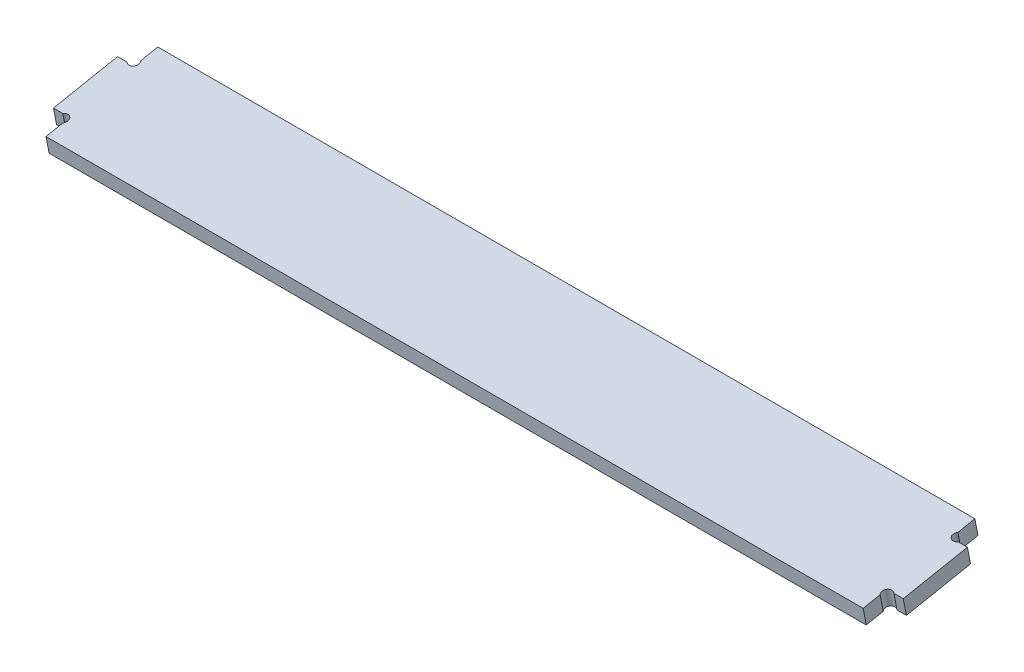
ISO-10303-21;
HEADER;
FILE_DESCRIPTION(('STEP AP214'),'2;1');
FILE_NAME('part.step','',(''),(''),'','','');
FILE_SCHEMA(('AUTOMOTIVE_DESIGN { 1 0 10303 214 1 1 1 1 }'));
ENDSEC;
DATA;
#1=APPLICATION_CONTEXT('core data for automotive mechanical design processes');
#2=APPLICATION_PROTOCOL_DEFINITION('international standard','automotive_design',2000,#1);
#3=PRODUCT_CONTEXT('',#1,'mechanical');
#4=PRODUCT('Part','Part','',(#3));
#5=PRODUCT_RELATED_PRODUCT_CATEGORY('part','',(#4));
#6=PRODUCT_DEFINITION_FORMATION('','',#4);
#7=PRODUCT_DEFINITION_CONTEXT('part definition',#1,'design');
#8=PRODUCT_DEFINITION('design','',#6,#7);
#9=PRODUCT_DEFINITION_SHAPE('','',#8);
#10=(LENGTH_UNIT() NAMED_UNIT(*) SI_UNIT(.MILLI.,.METRE.));
#11=(NAMED_UNIT(*) PLANE_ANGLE_UNIT() SI_UNIT($,.RADIAN.));
#12=(NAMED_UNIT(*) SI_UNIT($,.STERADIAN.) SOLID_ANGLE_UNIT());
#13=UNCERTAINTY_MEASURE_WITH_UNIT(LENGTH_MEASURE(1.E-05),#10,'distance_accuracy_value','');
#14=(GEOMETRIC_REPRESENTATION_CONTEXT(3) GLOBAL_UNCERTAINTY_ASSIGNED_CONTEXT((#13)) GLOBAL_UNIT_ASSIGNED_CONTEXT((#10,
#11,#12)) REPRESENTATION_CONTEXT('',''));
#15=CARTESIAN_POINT('',(0.,0.,0.));
#16=DIRECTION('',(0.,0.,1.));
#17=DIRECTION('',(1.,0.,0.));
#18=AXIS2_PLACEMENT_3D('',#15,#16,#17);
#19=CARTESIAN_POINT('',(0.,593.86769603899,-52.1972085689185));
#20=DIRECTION('',(-1.,0.,0.));
#21=DIRECTION('',(0.,0.229075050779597,0.973408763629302));
#22=AXIS2_PLACEMENT_3D('',#19,#20,#21);
#23=PLANE('',#22);
#24=DIRECTION('',(0.,0.981676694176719,0.19055410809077));
#25=VECTOR('',#24,1.);
#26=CARTESIAN_POINT('',(0.,492.61730867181,-70.4734239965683));
#27=LINE('',#26,#25);
#28=CARTESIAN_POINT('',(0.,505.409359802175,-67.9903479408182));
#29=VERTEX_POINT('',#28);
#30=CARTESIAN_POINT('',(0.,515.226126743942,-66.0848068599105));
#31=VERTEX_POINT('',#30);
#32=EDGE_CURVE('E295',#29,#31,#27,.T.);
#33=ORIENTED_EDGE('',*,*,#32,.F.);
#34=DIRECTION('',(0.,-0.190554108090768,0.981676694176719));
#35=VECTOR('',#34,1.);
#36=CARTESIAN_POINT('',(0.,494.152803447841,-10.));
#37=LINE('',#36,#35);
#38=CARTESIAN_POINT('',(0.,507.42684660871,-78.3838251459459));
#39=VERTEX_POINT('',#38);
#40=EDGE_CURVE('E218',#39,#29,#37,.T.);
#41=ORIENTED_EDGE('',*,*,#40,.F.);
#42=DIRECTION('',(0.,-0.981676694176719,-0.190554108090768));
#43=VECTOR('',#42,1.);
#44=CARTESIAN_POINT('',(0.,507.42684660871,-78.3838251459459));
#45=LINE('',#44,#43);
#46=CARTESIAN_POINT('',(0.,517.243613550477,-76.4782840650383));
#47=VERTEX_POINT('',#46);
#48=EDGE_CURVE('E214',#47,#39,#45,.T.);
#49=ORIENTED_EDGE('',*,*,#48,.F.);
#50=DIRECTION('',(0.,0.19055410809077,-0.981676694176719));
#51=VECTOR('',#50,1.);
#52=CARTESIAN_POINT('',(0.,503.969570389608,-8.09445891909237));
#53=LINE('',#52,#51);
#54=EDGE_CURVE('E248',#31,#47,#53,.T.);
#55=ORIENTED_EDGE('',*,*,#54,.F.);
#56=EDGE_LOOP('',(#33,#41,#49,#55));
#57=FACE_BOUND('',#56,.T.);
#58=ADVANCED_FACE('F33',(#57),#23,.F.);
#59=DIRECTION('',(0.,0.981676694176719,0.19055410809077));
#60=VECTOR('',#59,1.);
#61=CARTESIAN_POINT('',(0.,483.378239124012,-22.8765532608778));
#62=LINE('',#61,#60);
#63=CARTESIAN_POINT('',(0.,505.987057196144,-18.4879361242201));
#64=VERTEX_POINT('',#63);
#65=CARTESIAN_POINT('',(0.,496.170290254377,-20.3934772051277));
#66=VERTEX_POINT('',#65);
#67=EDGE_CURVE('E154',#64,#66,#62,.F.);
#68=ORIENTED_EDGE('',*,*,#67,.F.);
#69=CARTESIAN_POINT('',(0.,503.969570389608,-8.09445891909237));
#70=VERTEX_POINT('',#69);
#71=EDGE_CURVE('E152',#70,#64,#53,.T.);
#72=ORIENTED_EDGE('',*,*,#71,.F.);
#73=DIRECTION('',(0.,0.981676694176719,0.190554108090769));
#74=VECTOR('',#73,1.);
#75=CARTESIAN_POINT('',(0.,494.152803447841,-10.));
#76=LINE('',#75,#74);
#77=CARTESIAN_POINT('',(0.,494.152803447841,-10.));
#78=VERTEX_POINT('',#77);
#79=EDGE_CURVE('E221',#78,#70,#76,.T.);
#80=ORIENTED_EDGE('',*,*,#79,.F.);
#81=EDGE_CURVE('E217',#66,#78,#37,.T.);
#82=ORIENTED_EDGE('',*,*,#81,.F.);
#83=EDGE_LOOP('',(#68,#72,#80,#82));
#84=FACE_BOUND('',#83,.T.);
#85=ADVANCED_FACE('F292',(#84),#23,.F.);
#86=CARTESIAN_POINT('',(0.,504.600907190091,-63.8254464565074));
#87=DIRECTION('',(0.,-0.19055410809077,0.981676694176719));
#88=DIRECTION('',(0.,-0.981676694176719,-0.19055410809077));
#89=AXIS2_PLACEMENT_3D('',#86,#87,#88);
#90=PLANE('',#89);
#91=DIRECTION('',(0.,0.981676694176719,0.19055410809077));
#92=VECTOR('',#91,1.);
#93=CARTESIAN_POINT('',(4.24264068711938,491.808856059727,-66.3085225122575));
#94=LINE('',#93,#92);
#95=CARTESIAN_POINT('',(4.24264068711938,514.417674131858,-61.9199053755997));
#96=VERTEX_POINT('',#95);
#97=CARTESIAN_POINT('',(4.24264068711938,504.600907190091,-63.8254464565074));
#98=VERTEX_POINT('',#97);
#99=EDGE_CURVE('E11',#96,#98,#94,.F.);
#100=ORIENTED_EDGE('',*,*,#99,.F.);
#101=DIRECTION('',(1.,0.,0.));
#102=VECTOR('',#101,1.);
#103=CARTESIAN_POINT('',(0.,514.417674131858,-61.9199053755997));
#104=LINE('',#103,#102);
#105=CARTESIAN_POINT('',(10.,514.417674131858,-61.9199053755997));
#106=VERTEX_POINT('',#105);
#107=EDGE_CURVE('E166',#96,#106,#104,.T.);
#108=ORIENTED_EDGE('',*,*,#107,.T.);
#109=DIRECTION('',(0.,0.981676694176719,0.19055410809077));
#110=VECTOR('',#109,1.);
#111=CARTESIAN_POINT('',(10.,504.600907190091,-63.8254464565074));
#112=LINE('',#111,#110);
#113=CARTESIAN_POINT('',(10.,504.600907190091,-63.8254464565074));
#114=VERTEX_POINT('',#113);
#115=EDGE_CURVE('E173',#114,#106,#112,.T.);
#116=ORIENTED_EDGE('',*,*,#115,.F.);
#117=DIRECTION('',(1.,0.,0.));
#118=VECTOR('',#117,1.);
#119=CARTESIAN_POINT('',(0.,504.600907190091,-63.8254464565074));
#120=LINE('',#119,#118);
#121=EDGE_CURVE('E168',#98,#114,#120,.T.);
#122=ORIENTED_EDGE('',*,*,#121,.F.);
#123=EDGE_LOOP('',(#100,#108,#116,#122));
#124=FACE_BOUND('',#123,.T.);
#125=ADVANCED_FACE('F312',(#124),#90,.F.);
#126=CARTESIAN_POINT('',(0.,496.97874286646,-24.5583786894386));
#127=DIRECTION('',(0.,0.19055410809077,-0.981676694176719));
#128=DIRECTION('',(0.,0.981676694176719,0.19055410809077));
#129=AXIS2_PLACEMENT_3D('',#126,#127,#128);
#130=PLANE('',#129);
#131=DIRECTION('',(0.,0.981676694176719,0.19055410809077));
#132=VECTOR('',#131,1.);
#133=CARTESIAN_POINT('',(4.24264068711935,484.186691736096,-27.0414547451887));
#134=LINE('',#133,#132);
#135=CARTESIAN_POINT('',(4.24264068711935,496.97874286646,-24.5583786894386));
#136=VERTEX_POINT('',#135);
#137=CARTESIAN_POINT('',(4.24264068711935,506.795509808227,-22.6528376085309));
#138=VERTEX_POINT('',#137);
#139=EDGE_CURVE('E41',#136,#138,#134,.T.);
#140=ORIENTED_EDGE('',*,*,#139,.F.);
#141=DIRECTION('',(-1.,0.,0.));
#142=VECTOR('',#141,1.);
#143=CARTESIAN_POINT('',(0.,496.97874286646,-24.5583786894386));
#144=LINE('',#143,#142);
#145=CARTESIAN_POINT('',(10.,496.97874286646,-24.5583786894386));
#146=VERTEX_POINT('',#145);
#147=EDGE_CURVE('E302',#146,#136,#144,.T.);
#148=ORIENTED_EDGE('',*,*,#147,.F.);
#149=DIRECTION('',(0.,0.981676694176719,0.19055410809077));
#150=VECTOR('',#149,1.);
#151=CARTESIAN_POINT('',(10.,496.97874286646,-24.5583786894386));
#152=LINE('',#151,#150);
#153=CARTESIAN_POINT('',(10.,506.795509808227,-22.6528376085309));
#154=VERTEX_POINT('',#153);
#155=EDGE_CURVE('E164',#146,#154,#152,.T.);
#156=ORIENTED_EDGE('',*,*,#155,.T.);
#157=DIRECTION('',(-1.,0.,0.));
#158=VECTOR('',#157,1.);
#159=CARTESIAN_POINT('',(0.,506.795509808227,-22.6528376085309));
#160=LINE('',#159,#158);
#161=EDGE_CURVE('E150',#154,#138,#160,.T.);
#162=ORIENTED_EDGE('',*,*,#161,.T.);
#163=EDGE_LOOP('',(#140,#148,#156,#162));
#164=FACE_BOUND('',#163,.T.);
#165=ADVANCED_FACE('F162',(#164),#130,.F.);
#166=CARTESIAN_POINT('',(-500.,0.,0.));
#167=DIRECTION('',(-1.,0.,0.));
#168=DIRECTION('',(0.,0.,1.));
#169=AXIS2_PLACEMENT_3D('',#166,#167,#168);
#170=PLANE('',#169);
#171=DIRECTION('',(0.,0.981676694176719,0.19055410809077));
#172=VECTOR('',#171,1.);
#173=CARTESIAN_POINT('',(-500.,492.61730867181,-70.4734239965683));
#174=LINE('',#173,#172);
#175=CARTESIAN_POINT('',(-500.,515.226126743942,-66.0848068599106));
#176=VERTEX_POINT('',#175);
#177=CARTESIAN_POINT('',(-500.,505.409359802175,-67.9903479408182));
#178=VERTEX_POINT('',#177);
#179=EDGE_CURVE('E188',#176,#178,#174,.F.);
#180=ORIENTED_EDGE('',*,*,#179,.F.);
#181=DIRECTION('',(0.,-0.19055410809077,0.981676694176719));
#182=VECTOR('',#181,1.);
#183=CARTESIAN_POINT('',(-500.,503.969570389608,-8.09445891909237));
#184=LINE('',#183,#182);
#185=CARTESIAN_POINT('',(-500.,517.243613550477,-76.4782840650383));
#186=VERTEX_POINT('',#185);
#187=EDGE_CURVE('E235',#186,#176,#184,.T.);
#188=ORIENTED_EDGE('',*,*,#187,.F.);
#189=DIRECTION('',(0.,0.981676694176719,0.190554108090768));
#190=VECTOR('',#189,1.);
#191=CARTESIAN_POINT('',(-500.,507.42684660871,-78.3838251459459));
#192=LINE('',#191,#190);
#193=CARTESIAN_POINT('',(-500.,507.42684660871,-78.3838251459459));
#194=VERTEX_POINT('',#193);
#195=EDGE_CURVE('E231',#194,#186,#192,.T.);
#196=ORIENTED_EDGE('',*,*,#195,.F.);
#197=DIRECTION('',(0.,0.190554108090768,-0.981676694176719));
#198=VECTOR('',#197,1.);
#199=CARTESIAN_POINT('',(-500.,494.152803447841,-10.));
#200=LINE('',#199,#198);
#201=EDGE_CURVE('E227',#178,#194,#200,.T.);
#202=ORIENTED_EDGE('',*,*,#201,.F.);
#203=EDGE_LOOP('',(#180,#188,#196,#202));
#204=FACE_BOUND('',#203,.T.);
#205=ADVANCED_FACE('F267',(#204),#170,.T.);
#206=DIRECTION('',(0.,0.981676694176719,0.19055410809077));
#207=VECTOR('',#206,1.);
#208=CARTESIAN_POINT('',(-500.,483.378239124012,-22.8765532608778));
#209=LINE('',#208,#207);
#210=CARTESIAN_POINT('',(-500.,496.170290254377,-20.3934772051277));
#211=VERTEX_POINT('',#210);
#212=CARTESIAN_POINT('',(-500.,505.987057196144,-18.4879361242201));
#213=VERTEX_POINT('',#212);
#214=EDGE_CURVE('E183',#211,#213,#209,.T.);
#215=ORIENTED_EDGE('',*,*,#214,.F.);
#216=CARTESIAN_POINT('',(-500.,494.152803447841,-10.));
#217=VERTEX_POINT('',#216);
#218=EDGE_CURVE('E228',#217,#211,#200,.T.);
#219=ORIENTED_EDGE('',*,*,#218,.F.);
#220=DIRECTION('',(0.,-0.981676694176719,-0.190554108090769));
#221=VECTOR('',#220,1.);
#222=CARTESIAN_POINT('',(-500.,494.152803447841,-10.));
#223=LINE('',#222,#221);
#224=CARTESIAN_POINT('',(-500.,503.969570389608,-8.09445891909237));
#225=VERTEX_POINT('',#224);
#226=EDGE_CURVE('E211',#225,#217,#223,.T.);
#227=ORIENTED_EDGE('',*,*,#226,.F.);
#228=EDGE_CURVE('E234',#213,#225,#184,.T.);
#229=ORIENTED_EDGE('',*,*,#228,.F.);
#230=EDGE_LOOP('',(#215,#219,#227,#229));
#231=FACE_BOUND('',#230,.T.);
#232=ADVANCED_FACE('F285',(#231),#170,.T.);
#233=CARTESIAN_POINT('',(73.9850019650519,503.969570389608,-8.09445891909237));
#234=DIRECTION('',(0.,-0.981676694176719,-0.19055410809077));
#235=DIRECTION('',(0.,0.19055410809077,-0.981676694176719));
#236=AXIS2_PLACEMENT_3D('',#233,#234,#235);
#237=PLANE('',#236);
#238=CARTESIAN_POINT('',(2.12132034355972,514.8219004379,-64.0023561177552));
#239=DIRECTION('',(0.,-0.981676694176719,-0.19055410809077));
#240=DIRECTION('',(0.,0.19055410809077,-0.981676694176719));
#241=AXIS2_PLACEMENT_3D('',#238,#239,#240);
#242=CIRCLE('',#241,3.);
#243=EDGE_CURVE('E47',#31,#96,#242,.F.);
#244=ORIENTED_EDGE('',*,*,#243,.F.);
#245=ORIENTED_EDGE('',*,*,#54,.T.);
#246=DIRECTION('',(-1.,0.,0.));
#247=VECTOR('',#246,1.);
#248=CARTESIAN_POINT('',(73.9850019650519,517.243613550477,-76.4782840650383));
#249=LINE('',#248,#247);
#250=EDGE_CURVE('E241',#47,#186,#249,.T.);
#251=ORIENTED_EDGE('',*,*,#250,.T.);
#252=ORIENTED_EDGE('',*,*,#187,.T.);
#253=CARTESIAN_POINT('',(-502.12132034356,514.8219004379,-64.0023561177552));
#254=DIRECTION('',(0.,-0.981676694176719,-0.19055410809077));
#255=DIRECTION('',(0.,0.19055410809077,-0.981676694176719));
#256=AXIS2_PLACEMENT_3D('',#253,#254,#255);
#257=CIRCLE('',#256,3.);
#258=CARTESIAN_POINT('',(-504.242640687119,514.417674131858,-61.9199053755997));
#259=VERTEX_POINT('',#258);
#260=EDGE_CURVE('E189',#176,#259,#257,.T.);
#261=ORIENTED_EDGE('',*,*,#260,.T.);
#262=DIRECTION('',(-1.,0.,0.));
#263=VECTOR('',#262,1.);
#264=CARTESIAN_POINT('',(-500.,514.417674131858,-61.9199053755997));
#265=LINE('',#264,#263);
#266=CARTESIAN_POINT('',(-510.,514.417674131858,-61.9199053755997));
#267=VERTEX_POINT('',#266);
#268=EDGE_CURVE('E191',#259,#267,#265,.T.);
#269=ORIENTED_EDGE('',*,*,#268,.T.);
#270=DIRECTION('',(0.,-0.190554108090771,0.981676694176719));
#271=VECTOR('',#270,1.);
#272=CARTESIAN_POINT('',(-510.,514.417674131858,-61.9199053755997));
#273=LINE('',#272,#271);
#274=CARTESIAN_POINT('',(-510.,506.795509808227,-22.6528376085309));
#275=VERTEX_POINT('',#274);
#276=EDGE_CURVE('E204',#267,#275,#273,.T.);
#277=ORIENTED_EDGE('',*,*,#276,.T.);
#278=DIRECTION('',(1.,0.,0.));
#279=VECTOR('',#278,1.);
#280=CARTESIAN_POINT('',(-500.,506.795509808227,-22.6528376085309));
#281=LINE('',#280,#279);
#282=CARTESIAN_POINT('',(-504.242640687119,506.795509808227,-22.6528376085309));
#283=VERTEX_POINT('',#282);
#284=EDGE_CURVE('E196',#275,#283,#281,.T.);
#285=ORIENTED_EDGE('',*,*,#284,.T.);
#286=CARTESIAN_POINT('',(-502.12132034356,506.391283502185,-20.5703868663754));
#287=DIRECTION('',(0.,-0.981676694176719,-0.19055410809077));
#288=DIRECTION('',(0.,0.19055410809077,-0.981676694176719));
#289=AXIS2_PLACEMENT_3D('',#286,#287,#288);
#290=CIRCLE('',#289,2.99999999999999);
#291=EDGE_CURVE('E180',#283,#213,#290,.T.);
#292=ORIENTED_EDGE('',*,*,#291,.T.);
#293=ORIENTED_EDGE('',*,*,#228,.T.);
#294=DIRECTION('',(-1.,0.,0.));
#295=VECTOR('',#294,1.);
#296=CARTESIAN_POINT('',(73.9850019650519,503.969570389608,-8.09445891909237));
#297=LINE('',#296,#295);
#298=EDGE_CURVE('E238',#70,#225,#297,.T.);
#299=ORIENTED_EDGE('',*,*,#298,.F.);
#300=ORIENTED_EDGE('',*,*,#71,.T.);
#301=CARTESIAN_POINT('',(2.12132034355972,506.391283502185,-20.5703868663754));
#302=DIRECTION('',(0.,-0.981676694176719,-0.19055410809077));
#303=DIRECTION('',(0.,0.19055410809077,-0.981676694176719));
#304=AXIS2_PLACEMENT_3D('',#301,#302,#303);
#305=CIRCLE('',#304,2.99999999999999);
#306=EDGE_CURVE('E146',#138,#64,#305,.F.);
#307=ORIENTED_EDGE('',*,*,#306,.F.);
#308=ORIENTED_EDGE('',*,*,#161,.F.);
#309=DIRECTION('',(0.,-0.190554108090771,0.981676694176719));
#310=VECTOR('',#309,1.);
#311=CARTESIAN_POINT('',(10.,514.417674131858,-61.9199053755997));
#312=LINE('',#311,#310);
#313=EDGE_CURVE('E165',#106,#154,#312,.T.);
#314=ORIENTED_EDGE('',*,*,#313,.F.);
#315=ORIENTED_EDGE('',*,*,#107,.F.);
#316=EDGE_LOOP('',(#244,#245,#251,#252,#261,#269,#277,#285,#292,#293,#299,#300,#307,#308,#314,#315));
#317=FACE_BOUND('',#316,.T.);
#318=ADVANCED_FACE('F147',(#317),#237,.F.);
#319=CARTESIAN_POINT('',(73.9850019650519,507.42684660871,-78.3838251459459));
#320=DIRECTION('',(0.,-0.190554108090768,0.981676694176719));
#321=DIRECTION('',(0.,-0.981676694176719,-0.190554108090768));
#322=AXIS2_PLACEMENT_3D('',#319,#320,#321);
#323=PLANE('',#322);
#324=ORIENTED_EDGE('',*,*,#250,.F.);
#325=ORIENTED_EDGE('',*,*,#48,.T.);
#326=DIRECTION('',(-1.,0.,0.));
#327=VECTOR('',#326,1.);
#328=CARTESIAN_POINT('',(73.9850019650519,507.42684660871,-78.3838251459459));
#329=LINE('',#328,#327);
#330=EDGE_CURVE('E243',#39,#194,#329,.T.);
#331=ORIENTED_EDGE('',*,*,#330,.T.);
#332=ORIENTED_EDGE('',*,*,#195,.T.);
#333=EDGE_LOOP('',(#324,#325,#331,#332));
#334=FACE_BOUND('',#333,.T.);
#335=ADVANCED_FACE('F318',(#334),#323,.F.);
#336=CARTESIAN_POINT('',(73.9850019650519,494.152803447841,-10.));
#337=DIRECTION('',(0.,0.981676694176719,0.190554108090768));
#338=DIRECTION('',(0.,-0.190554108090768,0.981676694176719));
#339=AXIS2_PLACEMENT_3D('',#336,#337,#338);
#340=PLANE('',#339);
#341=ORIENTED_EDGE('',*,*,#40,.T.);
#342=CARTESIAN_POINT('',(2.12132034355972,505.005133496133,-65.9078971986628));
#343=DIRECTION('',(0.,0.981676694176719,0.190554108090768));
#344=DIRECTION('',(0.,-0.190554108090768,0.981676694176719));
#345=AXIS2_PLACEMENT_3D('',#342,#343,#344);
#346=CIRCLE('',#345,3.);
#347=EDGE_CURVE('E293',#98,#29,#346,.F.);
#348=ORIENTED_EDGE('',*,*,#347,.F.);
#349=ORIENTED_EDGE('',*,*,#121,.T.);
#350=DIRECTION('',(0.,-0.190554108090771,0.981676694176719));
#351=VECTOR('',#350,1.);
#352=CARTESIAN_POINT('',(10.,504.600907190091,-63.8254464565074));
#353=LINE('',#352,#351);
#354=EDGE_CURVE('E178',#114,#146,#353,.T.);
#355=ORIENTED_EDGE('',*,*,#354,.T.);
#356=ORIENTED_EDGE('',*,*,#147,.T.);
#357=CARTESIAN_POINT('',(2.12132034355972,496.574516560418,-22.4759279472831));
#358=DIRECTION('',(0.,0.981676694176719,0.190554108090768));
#359=DIRECTION('',(0.,-0.190554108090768,0.981676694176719));
#360=AXIS2_PLACEMENT_3D('',#357,#358,#359);
#361=CIRCLE('',#360,2.99999999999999);
#362=EDGE_CURVE('E55',#66,#136,#361,.F.);
#363=ORIENTED_EDGE('',*,*,#362,.F.);
#364=ORIENTED_EDGE('',*,*,#81,.T.);
#365=DIRECTION('',(-1.,0.,0.));
#366=VECTOR('',#365,1.);
#367=CARTESIAN_POINT('',(73.9850019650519,494.152803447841,-10.));
#368=LINE('',#367,#366);
#369=EDGE_CURVE('E246',#78,#217,#368,.T.);
#370=ORIENTED_EDGE('',*,*,#369,.T.);
#371=ORIENTED_EDGE('',*,*,#218,.T.);
#372=CARTESIAN_POINT('',(-502.12132034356,496.574516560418,-22.4759279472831));
#373=DIRECTION('',(0.,0.981676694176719,0.190554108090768));
#374=DIRECTION('',(0.,-0.190554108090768,0.981676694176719));
#375=AXIS2_PLACEMENT_3D('',#372,#373,#374);
#376=CIRCLE('',#375,2.99999999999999);
#377=CARTESIAN_POINT('',(-504.242640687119,496.97874286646,-24.5583786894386));
#378=VERTEX_POINT('',#377);
#379=EDGE_CURVE('E176',#211,#378,#376,.T.);
#380=ORIENTED_EDGE('',*,*,#379,.T.);
#381=DIRECTION('',(1.,0.,0.));
#382=VECTOR('',#381,1.);
#383=CARTESIAN_POINT('',(-500.,496.97874286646,-24.5583786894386));
#384=LINE('',#383,#382);
#385=CARTESIAN_POINT('',(-510.,496.97874286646,-24.5583786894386));
#386=VERTEX_POINT('',#385);
#387=EDGE_CURVE('E199',#386,#378,#384,.T.);
#388=ORIENTED_EDGE('',*,*,#387,.F.);
#389=DIRECTION('',(0.,-0.190554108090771,0.981676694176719));
#390=VECTOR('',#389,1.);
#391=CARTESIAN_POINT('',(-510.,504.600907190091,-63.8254464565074));
#392=LINE('',#391,#390);
#393=CARTESIAN_POINT('',(-510.,504.600907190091,-63.8254464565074));
#394=VERTEX_POINT('',#393);
#395=EDGE_CURVE('E195',#394,#386,#392,.T.);
#396=ORIENTED_EDGE('',*,*,#395,.F.);
#397=DIRECTION('',(-1.,0.,0.));
#398=VECTOR('',#397,1.);
#399=CARTESIAN_POINT('',(-500.,504.600907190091,-63.8254464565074));
#400=LINE('',#399,#398);
#401=CARTESIAN_POINT('',(-504.24264068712,504.600907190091,-63.8254464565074));
#402=VERTEX_POINT('',#401);
#403=EDGE_CURVE('E193',#402,#394,#400,.T.);
#404=ORIENTED_EDGE('',*,*,#403,.F.);
#405=CARTESIAN_POINT('',(-502.12132034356,505.005133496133,-65.9078971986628));
#406=DIRECTION('',(0.,0.981676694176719,0.190554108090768));
#407=DIRECTION('',(0.,-0.190554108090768,0.981676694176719));
#408=AXIS2_PLACEMENT_3D('',#405,#406,#407);
#409=CIRCLE('',#408,3.);
#410=EDGE_CURVE('E185',#402,#178,#409,.T.);
#411=ORIENTED_EDGE('',*,*,#410,.T.);
#412=ORIENTED_EDGE('',*,*,#201,.T.);
#413=ORIENTED_EDGE('',*,*,#330,.F.);
#414=EDGE_LOOP('',(#341,#348,#349,#355,#356,#363,#364,#370,#371,#380,#388,#396,#404,#411,#412,#413));
#415=FACE_BOUND('',#414,.T.);
#416=ADVANCED_FACE('F270',(#415),#340,.F.);
#417=CARTESIAN_POINT('',(73.9850019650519,494.152803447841,-10.));
#418=DIRECTION('',(0.,0.190554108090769,-0.981676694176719));
#419=DIRECTION('',(0.,0.981676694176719,0.190554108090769));
#420=AXIS2_PLACEMENT_3D('',#417,#418,#419);
#421=PLANE('',#420);
#422=ORIENTED_EDGE('',*,*,#369,.F.);
#423=ORIENTED_EDGE('',*,*,#79,.T.);
#424=ORIENTED_EDGE('',*,*,#298,.T.);
#425=ORIENTED_EDGE('',*,*,#226,.T.);
#426=EDGE_LOOP('',(#422,#423,#424,#425));
#427=FACE_BOUND('',#426,.T.);
#428=ADVANCED_FACE('F35',(#427),#421,.F.);
#429=CARTESIAN_POINT('',(-500.,504.600907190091,-63.8254464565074));
#430=DIRECTION('',(0.,0.19055410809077,-0.981676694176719));
#431=DIRECTION('',(0.,0.981676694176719,0.19055410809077));
#432=AXIS2_PLACEMENT_3D('',#429,#430,#431);
#433=PLANE('',#432);
#434=DIRECTION('',(0.,0.981676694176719,0.19055410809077));
#435=VECTOR('',#434,1.);
#436=CARTESIAN_POINT('',(-504.24264068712,491.808856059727,-66.3085225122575));
#437=LINE('',#436,#435);
#438=EDGE_CURVE('E160',#402,#259,#437,.T.);
#439=ORIENTED_EDGE('',*,*,#438,.F.);
#440=ORIENTED_EDGE('',*,*,#403,.T.);
#441=DIRECTION('',(0.,0.981676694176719,0.19055410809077));
#442=VECTOR('',#441,1.);
#443=CARTESIAN_POINT('',(-510.,504.600907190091,-63.8254464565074));
#444=LINE('',#443,#442);
#445=EDGE_CURVE('E202',#394,#267,#444,.T.);
#446=ORIENTED_EDGE('',*,*,#445,.T.);
#447=ORIENTED_EDGE('',*,*,#268,.F.);
#448=EDGE_LOOP('',(#439,#440,#446,#447));
#449=FACE_BOUND('',#448,.T.);
#450=ADVANCED_FACE('F260',(#449),#433,.T.);
#451=CARTESIAN_POINT('',(-500.,496.97874286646,-24.5583786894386));
#452=DIRECTION('',(0.,-0.19055410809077,0.981676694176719));
#453=DIRECTION('',(0.,-0.981676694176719,-0.19055410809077));
#454=AXIS2_PLACEMENT_3D('',#451,#452,#453);
#455=PLANE('',#454);
#456=DIRECTION('',(0.,0.981676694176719,0.19055410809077));
#457=VECTOR('',#456,1.);
#458=CARTESIAN_POINT('',(-504.242640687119,484.186691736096,-27.0414547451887));
#459=LINE('',#458,#457);
#460=EDGE_CURVE('E224',#283,#378,#459,.F.);
#461=ORIENTED_EDGE('',*,*,#460,.F.);
#462=ORIENTED_EDGE('',*,*,#284,.F.);
#463=DIRECTION('',(0.,0.981676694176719,0.19055410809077));
#464=VECTOR('',#463,1.);
#465=CARTESIAN_POINT('',(-510.,496.97874286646,-24.5583786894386));
#466=LINE('',#465,#464);
#467=EDGE_CURVE('E209',#386,#275,#466,.T.);
#468=ORIENTED_EDGE('',*,*,#467,.F.);
#469=ORIENTED_EDGE('',*,*,#387,.T.);
#470=EDGE_LOOP('',(#461,#462,#468,#469));
#471=FACE_BOUND('',#470,.T.);
#472=ADVANCED_FACE('F279',(#471),#455,.T.);
#473=CARTESIAN_POINT('',(-510.,504.600907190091,-63.8254464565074));
#474=DIRECTION('',(-1.,0.,0.));
#475=DIRECTION('',(0.,0.,1.));
#476=AXIS2_PLACEMENT_3D('',#473,#474,#475);
#477=PLANE('',#476);
#478=ORIENTED_EDGE('',*,*,#276,.F.);
#479=ORIENTED_EDGE('',*,*,#445,.F.);
#480=ORIENTED_EDGE('',*,*,#395,.T.);
#481=ORIENTED_EDGE('',*,*,#467,.T.);
#482=EDGE_LOOP('',(#478,#479,#480,#481));
#483=FACE_BOUND('',#482,.T.);
#484=ADVANCED_FACE('F275',(#483),#477,.T.);
#485=CARTESIAN_POINT('',(-502.12132034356,483.782465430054,-24.9590040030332));
#486=DIRECTION('',(0.,0.981676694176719,0.19055410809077));
#487=DIRECTION('',(0.,-0.19055410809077,0.981676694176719));
#488=AXIS2_PLACEMENT_3D('',#485,#486,#487);
#489=CYLINDRICAL_SURFACE('',#488,2.99999999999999);
#490=ORIENTED_EDGE('',*,*,#379,.F.);
#491=ORIENTED_EDGE('',*,*,#214,.T.);
#492=ORIENTED_EDGE('',*,*,#291,.F.);
#493=ORIENTED_EDGE('',*,*,#460,.T.);
#494=EDGE_LOOP('',(#490,#491,#492,#493));
#495=FACE_BOUND('',#494,.T.);
#496=ADVANCED_FACE('F351',(#495),#489,.F.);
#497=CARTESIAN_POINT('',(-502.12132034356,492.213082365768,-68.3909732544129));
#498=DIRECTION('',(0.,0.981676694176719,0.19055410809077));
#499=DIRECTION('',(0.,-0.19055410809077,0.981676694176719));
#500=AXIS2_PLACEMENT_3D('',#497,#498,#499);
#501=CYLINDRICAL_SURFACE('',#500,3.);
#502=ORIENTED_EDGE('',*,*,#179,.T.);
#503=ORIENTED_EDGE('',*,*,#410,.F.);
#504=ORIENTED_EDGE('',*,*,#438,.T.);
#505=ORIENTED_EDGE('',*,*,#260,.F.);
#506=EDGE_LOOP('',(#502,#503,#504,#505));
#507=FACE_BOUND('',#506,.T.);
#508=ADVANCED_FACE('F256',(#507),#501,.F.);
#509=CARTESIAN_POINT('',(10.,504.600907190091,-63.8254464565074));
#510=DIRECTION('',(-1.,0.,0.));
#511=DIRECTION('',(0.,0.,1.));
#512=AXIS2_PLACEMENT_3D('',#509,#510,#511);
#513=PLANE('',#512);
#514=ORIENTED_EDGE('',*,*,#313,.T.);
#515=ORIENTED_EDGE('',*,*,#155,.F.);
#516=ORIENTED_EDGE('',*,*,#354,.F.);
#517=ORIENTED_EDGE('',*,*,#115,.T.);
#518=EDGE_LOOP('',(#514,#515,#516,#517));
#519=FACE_BOUND('',#518,.T.);
#520=ADVANCED_FACE('F308',(#519),#513,.F.);
#521=CARTESIAN_POINT('',(2.12132034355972,483.782465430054,-24.9590040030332));
#522=DIRECTION('',(0.,0.981676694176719,0.19055410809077));
#523=DIRECTION('',(0.,-0.19055410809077,0.981676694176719));
#524=AXIS2_PLACEMENT_3D('',#521,#522,#523);
#525=CYLINDRICAL_SURFACE('',#524,2.99999999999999);
#526=ORIENTED_EDGE('',*,*,#139,.T.);
#527=ORIENTED_EDGE('',*,*,#306,.T.);
#528=ORIENTED_EDGE('',*,*,#67,.T.);
#529=ORIENTED_EDGE('',*,*,#362,.T.);
#530=EDGE_LOOP('',(#526,#527,#528,#529));
#531=FACE_BOUND('',#530,.T.);
#532=ADVANCED_FACE('F156',(#531),#525,.F.);
#533=CARTESIAN_POINT('',(2.12132034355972,492.213082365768,-68.3909732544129));
#534=DIRECTION('',(0.,0.981676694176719,0.19055410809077));
#535=DIRECTION('',(0.,-0.19055410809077,0.981676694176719));
#536=AXIS2_PLACEMENT_3D('',#533,#534,#535);
#537=CYLINDRICAL_SURFACE('',#536,3.);
#538=ORIENTED_EDGE('',*,*,#243,.T.);
#539=ORIENTED_EDGE('',*,*,#99,.T.);
#540=ORIENTED_EDGE('',*,*,#347,.T.);
#541=ORIENTED_EDGE('',*,*,#32,.T.);
#542=EDGE_LOOP('',(#538,#539,#540,#541));
#543=FACE_BOUND('',#542,.T.);
#544=ADVANCED_FACE('F313',(#543),#537,.F.);
#545=CLOSED_SHELL('',(#58,#85,#125,#165,#205,#232,#318,#335,#416,#428,#450,#472,#484,#496,#508,
#520,#532,#544));
#546=MANIFOLD_SOLID_BREP('B2',#545);
#547=ADVANCED_BREP_SHAPE_REPRESENTATION('',(#18,#546),#14);
#548=SHAPE_DEFINITION_REPRESENTATION(#9,#547);
ENDSEC;
END-ISO-10303-21;
